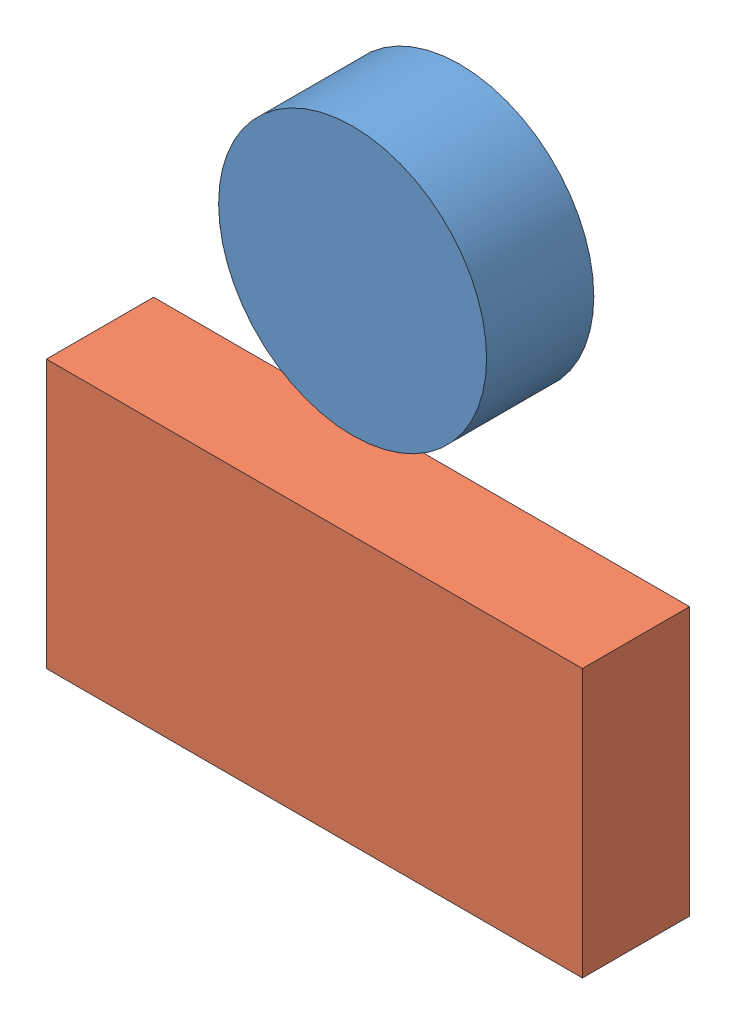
SolidWorks assembly DWXBgr.SLDASM, configuration Standard (file format 6000). Lengths in mm.
Overall size (50 53.1 15).
2 component instances, 2 part files, 0 mates.
Components (placement in the parent):
- Scheibe-1: Scheibe.SLDPRT [Standard] at origin size (25 25 10)
- Klotz-1: Klotz.SLDPRT [Standard] at (-23.5641 -40.6017 5) size (50 25 10)
